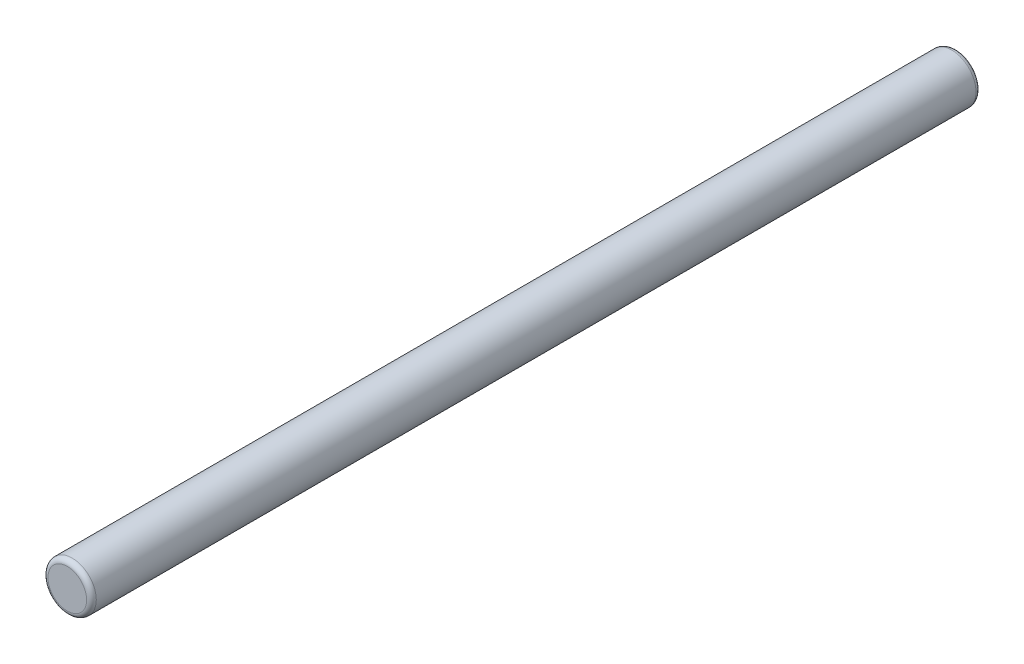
ISO-10303-21;
HEADER;
FILE_DESCRIPTION(('STEP AP214'),'2;1');
FILE_NAME('part.step','',(''),(''),'','','');
FILE_SCHEMA(('AUTOMOTIVE_DESIGN { 1 0 10303 214 1 1 1 1 }'));
ENDSEC;
DATA;
#1=APPLICATION_CONTEXT('core data for automotive mechanical design processes');
#2=APPLICATION_PROTOCOL_DEFINITION('international standard','automotive_design',2000,#1);
#3=PRODUCT_CONTEXT('',#1,'mechanical');
#4=PRODUCT('Part','Part','',(#3));
#5=PRODUCT_RELATED_PRODUCT_CATEGORY('part','',(#4));
#6=PRODUCT_DEFINITION_FORMATION('','',#4);
#7=PRODUCT_DEFINITION_CONTEXT('part definition',#1,'design');
#8=PRODUCT_DEFINITION('design','',#6,#7);
#9=PRODUCT_DEFINITION_SHAPE('','',#8);
#10=(LENGTH_UNIT() NAMED_UNIT(*) SI_UNIT(.MILLI.,.METRE.));
#11=(NAMED_UNIT(*) PLANE_ANGLE_UNIT() SI_UNIT($,.RADIAN.));
#12=(NAMED_UNIT(*) SI_UNIT($,.STERADIAN.) SOLID_ANGLE_UNIT());
#13=UNCERTAINTY_MEASURE_WITH_UNIT(LENGTH_MEASURE(1.E-05),#10,'distance_accuracy_value','');
#14=(GEOMETRIC_REPRESENTATION_CONTEXT(3) GLOBAL_UNCERTAINTY_ASSIGNED_CONTEXT((#13)) GLOBAL_UNIT_ASSIGNED_CONTEXT((#10,
#11,#12)) REPRESENTATION_CONTEXT('',''));
#15=CARTESIAN_POINT('',(0.,0.,0.));
#16=DIRECTION('',(0.,0.,1.));
#17=DIRECTION('',(1.,0.,0.));
#18=AXIS2_PLACEMENT_3D('',#15,#16,#17);
#19=CARTESIAN_POINT('',(0.,0.,-36.8));
#20=DIRECTION('',(0.,0.,1.));
#21=DIRECTION('',(1.,0.,0.));
#22=AXIS2_PLACEMENT_3D('',#19,#20,#21);
#23=CYLINDRICAL_SURFACE('',#22,1.);
#24=CARTESIAN_POINT('',(0.,0.,-36.6));
#25=DIRECTION('',(0.,0.,1.));
#26=DIRECTION('',(1.,0.,0.));
#27=AXIS2_PLACEMENT_3D('',#24,#25,#26);
#28=CIRCLE('',#27,1.);
#29=CARTESIAN_POINT('',(1.,0.,-36.6));
#30=VERTEX_POINT('',#29);
#31=EDGE_CURVE('E34',#30,#30,#28,.T.);
#32=ORIENTED_EDGE('',*,*,#31,.T.);
#33=EDGE_LOOP('',(#32));
#34=FACE_BOUND('',#33,.T.);
#35=CARTESIAN_POINT('',(0.,0.,-0.199999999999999));
#36=DIRECTION('',(0.,0.,1.));
#37=DIRECTION('',(1.,0.,0.));
#38=AXIS2_PLACEMENT_3D('',#35,#36,#37);
#39=CIRCLE('',#38,1.);
#40=CARTESIAN_POINT('',(1.,0.,-0.199999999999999));
#41=VERTEX_POINT('',#40);
#42=EDGE_CURVE('E38',#41,#41,#39,.F.);
#43=ORIENTED_EDGE('',*,*,#42,.T.);
#44=EDGE_LOOP('',(#43));
#45=FACE_BOUND('',#44,.T.);
#46=ADVANCED_FACE('F24',(#34,#45),#23,.T.);
#47=CARTESIAN_POINT('',(0.,0.,-36.8));
#48=DIRECTION('',(0.,0.,1.));
#49=DIRECTION('',(1.,0.,0.));
#50=AXIS2_PLACEMENT_3D('',#47,#48,#49);
#51=PLANE('',#50);
#52=CARTESIAN_POINT('',(0.,0.,-36.8));
#53=DIRECTION('',(0.,0.,1.));
#54=DIRECTION('',(1.,0.,0.));
#55=AXIS2_PLACEMENT_3D('',#52,#53,#54);
#56=CIRCLE('',#55,0.800000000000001);
#57=CARTESIAN_POINT('',(0.800000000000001,0.,-36.8));
#58=VERTEX_POINT('',#57);
#59=EDGE_CURVE('E30',#58,#58,#56,.F.);
#60=ORIENTED_EDGE('',*,*,#59,.T.);
#61=EDGE_LOOP('',(#60));
#62=FACE_BOUND('',#61,.T.);
#63=ADVANCED_FACE('F57',(#62),#51,.F.);
#64=CARTESIAN_POINT('',(0.,0.,0.));
#65=DIRECTION('',(0.,0.,1.));
#66=DIRECTION('',(1.,0.,0.));
#67=AXIS2_PLACEMENT_3D('',#64,#65,#66);
#68=PLANE('',#67);
#69=CARTESIAN_POINT('',(0.,0.,0.));
#70=DIRECTION('',(0.,0.,1.));
#71=DIRECTION('',(1.,0.,0.));
#72=AXIS2_PLACEMENT_3D('',#69,#70,#71);
#73=CIRCLE('',#72,0.800000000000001);
#74=CARTESIAN_POINT('',(0.800000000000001,0.,0.));
#75=VERTEX_POINT('',#74);
#76=EDGE_CURVE('E10',#75,#75,#73,.T.);
#77=ORIENTED_EDGE('',*,*,#76,.T.);
#78=EDGE_LOOP('',(#77));
#79=FACE_BOUND('',#78,.T.);
#80=ADVANCED_FACE('F53',(#79),#68,.T.);
#81=CARTESIAN_POINT('',(0.,0.,-36.6));
#82=DIRECTION('',(0.,0.,1.));
#83=DIRECTION('',(1.,0.,0.));
#84=AXIS2_PLACEMENT_3D('',#81,#82,#83);
#85=TOROIDAL_SURFACE('',#84,0.800000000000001,0.2);
#86=ORIENTED_EDGE('',*,*,#59,.F.);
#87=EDGE_LOOP('',(#86));
#88=FACE_BOUND('',#87,.T.);
#89=ORIENTED_EDGE('',*,*,#31,.F.);
#90=EDGE_LOOP('',(#89));
#91=FACE_BOUND('',#90,.T.);
#92=ADVANCED_FACE('F48',(#88,#91),#85,.T.);
#93=CARTESIAN_POINT('',(0.,0.,-0.199999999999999));
#94=DIRECTION('',(0.,0.,1.));
#95=DIRECTION('',(1.,0.,0.));
#96=AXIS2_PLACEMENT_3D('',#93,#94,#95);
#97=TOROIDAL_SURFACE('',#96,0.800000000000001,0.2);
#98=ORIENTED_EDGE('',*,*,#42,.F.);
#99=EDGE_LOOP('',(#98));
#100=FACE_BOUND('',#99,.T.);
#101=ORIENTED_EDGE('',*,*,#76,.F.);
#102=EDGE_LOOP('',(#101));
#103=FACE_BOUND('',#102,.T.);
#104=ADVANCED_FACE('F45',(#100,#103),#97,.T.);
#105=CLOSED_SHELL('',(#46,#63,#80,#92,#104));
#106=MANIFOLD_SOLID_BREP('B2',#105);
#107=ADVANCED_BREP_SHAPE_REPRESENTATION('',(#18,#106),#14);
#108=SHAPE_DEFINITION_REPRESENTATION(#9,#107);
ENDSEC;
END-ISO-10303-21;
